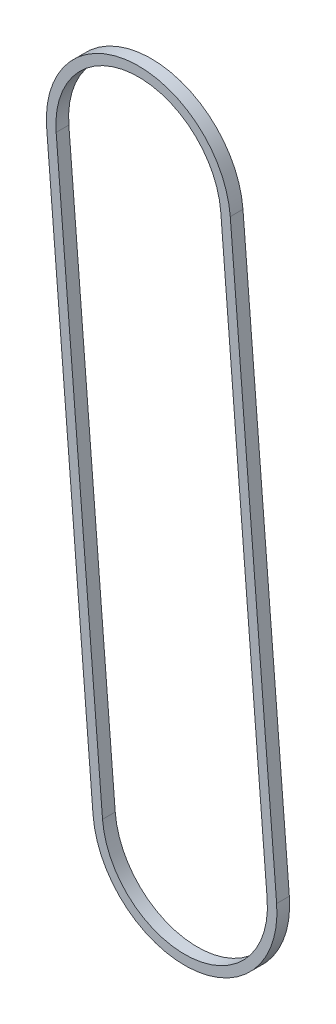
ISO-10303-21;
HEADER;
FILE_DESCRIPTION(('STEP AP214'),'2;1');
FILE_NAME('part.step','',(''),(''),'','','');
FILE_SCHEMA(('AUTOMOTIVE_DESIGN { 1 0 10303 214 1 1 1 1 }'));
ENDSEC;
DATA;
#1=APPLICATION_CONTEXT('core data for automotive mechanical design processes');
#2=APPLICATION_PROTOCOL_DEFINITION('international standard','automotive_design',2000,#1);
#3=PRODUCT_CONTEXT('',#1,'mechanical');
#4=PRODUCT('Part','Part','',(#3));
#5=PRODUCT_RELATED_PRODUCT_CATEGORY('part','',(#4));
#6=PRODUCT_DEFINITION_FORMATION('','',#4);
#7=PRODUCT_DEFINITION_CONTEXT('part definition',#1,'design');
#8=PRODUCT_DEFINITION('design','',#6,#7);
#9=PRODUCT_DEFINITION_SHAPE('','',#8);
#10=(LENGTH_UNIT() NAMED_UNIT(*) SI_UNIT(.MILLI.,.METRE.));
#11=(NAMED_UNIT(*) PLANE_ANGLE_UNIT() SI_UNIT($,.RADIAN.));
#12=(NAMED_UNIT(*) SI_UNIT($,.STERADIAN.) SOLID_ANGLE_UNIT());
#13=UNCERTAINTY_MEASURE_WITH_UNIT(LENGTH_MEASURE(1.E-05),#10,'distance_accuracy_value','');
#14=(GEOMETRIC_REPRESENTATION_CONTEXT(3) GLOBAL_UNCERTAINTY_ASSIGNED_CONTEXT((#13)) GLOBAL_UNIT_ASSIGNED_CONTEXT((#10,
#11,#12)) REPRESENTATION_CONTEXT('',''));
#15=CARTESIAN_POINT('',(0.,0.,0.));
#16=DIRECTION('',(0.,0.,1.));
#17=DIRECTION('',(1.,0.,0.));
#18=AXIS2_PLACEMENT_3D('',#15,#16,#17);
#19=CARTESIAN_POINT('',(-73.0000000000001,900.,10.));
#20=DIRECTION('',(0.,0.,1.));
#21=DIRECTION('',(1.,0.,0.));
#22=AXIS2_PLACEMENT_3D('',#19,#20,#21);
#23=PLANE('',#22);
#24=CARTESIAN_POINT('',(-73.0000000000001,900.,10.));
#25=DIRECTION('',(0.,0.,1.));
#26=DIRECTION('',(1.,0.,0.));
#27=AXIS2_PLACEMENT_3D('',#24,#25,#26);
#28=CIRCLE('',#27,145.);
#29=CARTESIAN_POINT('',(71.5253623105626,911.722612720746,10.));
#30=VERTEX_POINT('',#29);
#31=CARTESIAN_POINT('',(-217.525362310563,888.277387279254,10.));
#32=VERTEX_POINT('',#31);
#33=EDGE_CURVE('E159',#30,#32,#28,.T.);
#34=ORIENTED_EDGE('',*,*,#33,.T.);
#35=DIRECTION('',(0.0808456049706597,-0.99672663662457,0.));
#36=VECTOR('',#35,1.);
#37=CARTESIAN_POINT('',(-217.525362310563,888.277387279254,10.));
#38=LINE('',#37,#36);
#39=CARTESIAN_POINT('',(-144.525362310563,-11.7226127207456,10.));
#40=VERTEX_POINT('',#39);
#41=EDGE_CURVE('E162',#32,#40,#38,.T.);
#42=ORIENTED_EDGE('',*,*,#41,.T.);
#43=CARTESIAN_POINT('',(0.,0.,10.));
#44=DIRECTION('',(0.,0.,1.));
#45=DIRECTION('',(1.,0.,0.));
#46=AXIS2_PLACEMENT_3D('',#43,#44,#45);
#47=CIRCLE('',#46,145.);
#48=CARTESIAN_POINT('',(144.525362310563,11.7226127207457,10.));
#49=VERTEX_POINT('',#48);
#50=EDGE_CURVE('E165',#40,#49,#47,.T.);
#51=ORIENTED_EDGE('',*,*,#50,.T.);
#52=DIRECTION('',(0.0808456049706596,-0.99672663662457,0.));
#53=VECTOR('',#52,1.);
#54=CARTESIAN_POINT('',(71.5253623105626,911.722612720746,10.));
#55=LINE('',#54,#53);
#56=EDGE_CURVE('E167',#30,#49,#55,.T.);
#57=ORIENTED_EDGE('',*,*,#56,.F.);
#58=EDGE_LOOP('',(#34,#42,#51,#57));
#59=FACE_BOUND('',#58,.T.);
#60=CARTESIAN_POINT('',(0.,0.,10.));
#61=DIRECTION('',(0.,0.,1.));
#62=DIRECTION('',(1.,0.,0.));
#63=AXIS2_PLACEMENT_3D('',#60,#61,#62);
#64=CIRCLE('',#63,130.);
#65=CARTESIAN_POINT('',(-129.574462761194,-10.5099286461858,10.));
#66=VERTEX_POINT('',#65);
#67=CARTESIAN_POINT('',(129.574462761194,10.5099286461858,10.));
#68=VERTEX_POINT('',#67);
#69=EDGE_CURVE('E133',#66,#68,#64,.T.);
#70=ORIENTED_EDGE('',*,*,#69,.F.);
#71=DIRECTION('',(0.0808456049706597,-0.99672663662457,0.));
#72=VECTOR('',#71,1.);
#73=CARTESIAN_POINT('',(-202.574462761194,889.490071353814,10.));
#74=LINE('',#73,#72);
#75=CARTESIAN_POINT('',(-202.574462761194,889.490071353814,10.));
#76=VERTEX_POINT('',#75);
#77=EDGE_CURVE('E125',#76,#66,#74,.T.);
#78=ORIENTED_EDGE('',*,*,#77,.F.);
#79=CARTESIAN_POINT('',(-73.0000000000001,900.,10.));
#80=DIRECTION('',(0.,0.,1.));
#81=DIRECTION('',(1.,0.,0.));
#82=AXIS2_PLACEMENT_3D('',#79,#80,#81);
#83=CIRCLE('',#82,130.);
#84=CARTESIAN_POINT('',(56.5744627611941,910.509928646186,10.));
#85=VERTEX_POINT('',#84);
#86=EDGE_CURVE('E144',#85,#76,#83,.T.);
#87=ORIENTED_EDGE('',*,*,#86,.F.);
#88=DIRECTION('',(0.0808456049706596,-0.99672663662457,0.));
#89=VECTOR('',#88,1.);
#90=CARTESIAN_POINT('',(56.5744627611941,910.509928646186,10.));
#91=LINE('',#90,#89);
#92=EDGE_CURVE('E74',#85,#68,#91,.T.);
#93=ORIENTED_EDGE('',*,*,#92,.T.);
#94=EDGE_LOOP('',(#70,#78,#87,#93));
#95=FACE_BOUND('',#94,.T.);
#96=ADVANCED_FACE('F59',(#59,#95),#23,.T.);
#97=CARTESIAN_POINT('',(-73.0000000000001,900.,-10.));
#98=DIRECTION('',(0.,0.,1.));
#99=DIRECTION('',(1.,0.,0.));
#100=AXIS2_PLACEMENT_3D('',#97,#98,#99);
#101=PLANE('',#100);
#102=CARTESIAN_POINT('',(-73.0000000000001,900.,-10.));
#103=DIRECTION('',(0.,0.,1.));
#104=DIRECTION('',(1.,0.,0.));
#105=AXIS2_PLACEMENT_3D('',#102,#103,#104);
#106=CIRCLE('',#105,145.);
#107=CARTESIAN_POINT('',(71.5253623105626,911.722612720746,-10.));
#108=VERTEX_POINT('',#107);
#109=CARTESIAN_POINT('',(-217.525362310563,888.277387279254,-10.));
#110=VERTEX_POINT('',#109);
#111=EDGE_CURVE('E140',#108,#110,#106,.T.);
#112=ORIENTED_EDGE('',*,*,#111,.F.);
#113=DIRECTION('',(0.0808456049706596,-0.99672663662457,0.));
#114=VECTOR('',#113,1.);
#115=CARTESIAN_POINT('',(71.5253623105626,911.722612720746,-10.));
#116=LINE('',#115,#114);
#117=CARTESIAN_POINT('',(144.525362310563,11.7226127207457,-10.));
#118=VERTEX_POINT('',#117);
#119=EDGE_CURVE('E163',#108,#118,#116,.T.);
#120=ORIENTED_EDGE('',*,*,#119,.T.);
#121=CARTESIAN_POINT('',(0.,0.,-10.));
#122=DIRECTION('',(0.,0.,1.));
#123=DIRECTION('',(1.,0.,0.));
#124=AXIS2_PLACEMENT_3D('',#121,#122,#123);
#125=CIRCLE('',#124,145.);
#126=CARTESIAN_POINT('',(-144.525362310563,-11.7226127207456,-10.));
#127=VERTEX_POINT('',#126);
#128=EDGE_CURVE('E175',#127,#118,#125,.T.);
#129=ORIENTED_EDGE('',*,*,#128,.F.);
#130=DIRECTION('',(0.0808456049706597,-0.99672663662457,0.));
#131=VECTOR('',#130,1.);
#132=CARTESIAN_POINT('',(-217.525362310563,888.277387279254,-10.));
#133=LINE('',#132,#131);
#134=EDGE_CURVE('E173',#110,#127,#133,.T.);
#135=ORIENTED_EDGE('',*,*,#134,.F.);
#136=EDGE_LOOP('',(#112,#120,#129,#135));
#137=FACE_BOUND('',#136,.T.);
#138=DIRECTION('',(0.0808456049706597,-0.99672663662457,0.));
#139=VECTOR('',#138,1.);
#140=CARTESIAN_POINT('',(-202.574462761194,889.490071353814,-10.));
#141=LINE('',#140,#139);
#142=CARTESIAN_POINT('',(-202.574462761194,889.490071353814,-10.));
#143=VERTEX_POINT('',#142);
#144=CARTESIAN_POINT('',(-129.574462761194,-10.5099286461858,-10.));
#145=VERTEX_POINT('',#144);
#146=EDGE_CURVE('E82',#143,#145,#141,.T.);
#147=ORIENTED_EDGE('',*,*,#146,.T.);
#148=CARTESIAN_POINT('',(0.,0.,-10.));
#149=DIRECTION('',(0.,0.,1.));
#150=DIRECTION('',(1.,0.,0.));
#151=AXIS2_PLACEMENT_3D('',#148,#149,#150);
#152=CIRCLE('',#151,130.);
#153=CARTESIAN_POINT('',(129.574462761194,10.5099286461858,-10.));
#154=VERTEX_POINT('',#153);
#155=EDGE_CURVE('E139',#145,#154,#152,.T.);
#156=ORIENTED_EDGE('',*,*,#155,.T.);
#157=DIRECTION('',(0.0808456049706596,-0.99672663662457,0.));
#158=VECTOR('',#157,1.);
#159=CARTESIAN_POINT('',(56.5744627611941,910.509928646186,-10.));
#160=LINE('',#159,#158);
#161=CARTESIAN_POINT('',(56.5744627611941,910.509928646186,-10.));
#162=VERTEX_POINT('',#161);
#163=EDGE_CURVE('E150',#162,#154,#160,.T.);
#164=ORIENTED_EDGE('',*,*,#163,.F.);
#165=CARTESIAN_POINT('',(-73.0000000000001,900.,-10.));
#166=DIRECTION('',(0.,0.,1.));
#167=DIRECTION('',(1.,0.,0.));
#168=AXIS2_PLACEMENT_3D('',#165,#166,#167);
#169=CIRCLE('',#168,130.);
#170=EDGE_CURVE('E134',#162,#143,#169,.T.);
#171=ORIENTED_EDGE('',*,*,#170,.T.);
#172=EDGE_LOOP('',(#147,#156,#164,#171));
#173=FACE_BOUND('',#172,.T.);
#174=ADVANCED_FACE('F192',(#137,#173),#101,.F.);
#175=CARTESIAN_POINT('',(-73.0000000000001,900.,10.));
#176=DIRECTION('',(0.,0.,-1.));
#177=DIRECTION('',(-1.,0.,0.));
#178=AXIS2_PLACEMENT_3D('',#175,#176,#177);
#179=CYLINDRICAL_SURFACE('',#178,145.);
#180=ORIENTED_EDGE('',*,*,#111,.T.);
#181=DIRECTION('',(0.,0.,-1.));
#182=VECTOR('',#181,1.);
#183=CARTESIAN_POINT('',(-217.525362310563,888.277387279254,10.));
#184=LINE('',#183,#182);
#185=EDGE_CURVE('E12',#32,#110,#184,.T.);
#186=ORIENTED_EDGE('',*,*,#185,.F.);
#187=ORIENTED_EDGE('',*,*,#33,.F.);
#188=DIRECTION('',(0.,0.,-1.));
#189=VECTOR('',#188,1.);
#190=CARTESIAN_POINT('',(71.5253623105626,911.722612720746,10.));
#191=LINE('',#190,#189);
#192=EDGE_CURVE('E170',#30,#108,#191,.T.);
#193=ORIENTED_EDGE('',*,*,#192,.T.);
#194=EDGE_LOOP('',(#180,#186,#187,#193));
#195=FACE_BOUND('',#194,.T.);
#196=ADVANCED_FACE('F61',(#195),#179,.T.);
#197=CARTESIAN_POINT('',(-217.525362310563,888.277387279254,10.));
#198=DIRECTION('',(0.99672663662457,0.0808456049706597,0.));
#199=DIRECTION('',(-0.0808456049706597,0.99672663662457,0.));
#200=AXIS2_PLACEMENT_3D('',#197,#198,#199);
#201=PLANE('',#200);
#202=ORIENTED_EDGE('',*,*,#134,.T.);
#203=DIRECTION('',(0.,0.,-1.));
#204=VECTOR('',#203,1.);
#205=CARTESIAN_POINT('',(-144.525362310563,-11.7226127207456,10.));
#206=LINE('',#205,#204);
#207=EDGE_CURVE('E67',#40,#127,#206,.T.);
#208=ORIENTED_EDGE('',*,*,#207,.F.);
#209=ORIENTED_EDGE('',*,*,#41,.F.);
#210=ORIENTED_EDGE('',*,*,#185,.T.);
#211=EDGE_LOOP('',(#202,#208,#209,#210));
#212=FACE_BOUND('',#211,.T.);
#213=ADVANCED_FACE('F201',(#212),#201,.F.);
#214=CARTESIAN_POINT('',(0.,0.,10.));
#215=DIRECTION('',(0.,0.,-1.));
#216=DIRECTION('',(-1.,0.,0.));
#217=AXIS2_PLACEMENT_3D('',#214,#215,#216);
#218=CYLINDRICAL_SURFACE('',#217,145.);
#219=ORIENTED_EDGE('',*,*,#128,.T.);
#220=DIRECTION('',(0.,0.,-1.));
#221=VECTOR('',#220,1.);
#222=CARTESIAN_POINT('',(144.525362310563,11.7226127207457,10.));
#223=LINE('',#222,#221);
#224=EDGE_CURVE('E181',#49,#118,#223,.T.);
#225=ORIENTED_EDGE('',*,*,#224,.F.);
#226=ORIENTED_EDGE('',*,*,#50,.F.);
#227=ORIENTED_EDGE('',*,*,#207,.T.);
#228=EDGE_LOOP('',(#219,#225,#226,#227));
#229=FACE_BOUND('',#228,.T.);
#230=ADVANCED_FACE('F187',(#229),#218,.T.);
#231=CARTESIAN_POINT('',(71.5253623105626,911.722612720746,10.));
#232=DIRECTION('',(0.99672663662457,0.0808456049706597,0.));
#233=DIRECTION('',(-0.0808456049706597,0.99672663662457,0.));
#234=AXIS2_PLACEMENT_3D('',#231,#232,#233);
#235=PLANE('',#234);
#236=ORIENTED_EDGE('',*,*,#119,.F.);
#237=ORIENTED_EDGE('',*,*,#192,.F.);
#238=ORIENTED_EDGE('',*,*,#56,.T.);
#239=ORIENTED_EDGE('',*,*,#224,.T.);
#240=EDGE_LOOP('',(#236,#237,#238,#239));
#241=FACE_BOUND('',#240,.T.);
#242=ADVANCED_FACE('F196',(#241),#235,.T.);
#243=CARTESIAN_POINT('',(-202.574462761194,889.490071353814,10.));
#244=DIRECTION('',(0.99672663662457,0.0808456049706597,0.));
#245=DIRECTION('',(-0.0808456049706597,0.99672663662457,0.));
#246=AXIS2_PLACEMENT_3D('',#243,#244,#245);
#247=PLANE('',#246);
#248=ORIENTED_EDGE('',*,*,#146,.F.);
#249=DIRECTION('',(0.,0.,-1.));
#250=VECTOR('',#249,1.);
#251=CARTESIAN_POINT('',(-202.574462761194,889.490071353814,10.));
#252=LINE('',#251,#250);
#253=EDGE_CURVE('E129',#76,#143,#252,.T.);
#254=ORIENTED_EDGE('',*,*,#253,.F.);
#255=ORIENTED_EDGE('',*,*,#77,.T.);
#256=DIRECTION('',(0.,0.,-1.));
#257=VECTOR('',#256,1.);
#258=CARTESIAN_POINT('',(-129.574462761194,-10.5099286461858,10.));
#259=LINE('',#258,#257);
#260=EDGE_CURVE('E128',#66,#145,#259,.T.);
#261=ORIENTED_EDGE('',*,*,#260,.T.);
#262=EDGE_LOOP('',(#248,#254,#255,#261));
#263=FACE_BOUND('',#262,.T.);
#264=ADVANCED_FACE('F127',(#263),#247,.T.);
#265=CARTESIAN_POINT('',(0.,0.,10.));
#266=DIRECTION('',(0.,0.,-1.));
#267=DIRECTION('',(-1.,0.,0.));
#268=AXIS2_PLACEMENT_3D('',#265,#266,#267);
#269=CYLINDRICAL_SURFACE('',#268,130.);
#270=ORIENTED_EDGE('',*,*,#155,.F.);
#271=ORIENTED_EDGE('',*,*,#260,.F.);
#272=ORIENTED_EDGE('',*,*,#69,.T.);
#273=DIRECTION('',(0.,0.,-1.));
#274=VECTOR('',#273,1.);
#275=CARTESIAN_POINT('',(129.574462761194,10.5099286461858,10.));
#276=LINE('',#275,#274);
#277=EDGE_CURVE('E141',#68,#154,#276,.T.);
#278=ORIENTED_EDGE('',*,*,#277,.T.);
#279=EDGE_LOOP('',(#270,#271,#272,#278));
#280=FACE_BOUND('',#279,.T.);
#281=ADVANCED_FACE('F137',(#280),#269,.F.);
#282=CARTESIAN_POINT('',(56.5744627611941,910.509928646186,10.));
#283=DIRECTION('',(0.99672663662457,0.0808456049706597,0.));
#284=DIRECTION('',(-0.0808456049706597,0.99672663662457,0.));
#285=AXIS2_PLACEMENT_3D('',#282,#283,#284);
#286=PLANE('',#285);
#287=ORIENTED_EDGE('',*,*,#163,.T.);
#288=ORIENTED_EDGE('',*,*,#277,.F.);
#289=ORIENTED_EDGE('',*,*,#92,.F.);
#290=DIRECTION('',(0.,0.,-1.));
#291=VECTOR('',#290,1.);
#292=CARTESIAN_POINT('',(56.5744627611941,910.509928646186,10.));
#293=LINE('',#292,#291);
#294=EDGE_CURVE('E156',#85,#162,#293,.T.);
#295=ORIENTED_EDGE('',*,*,#294,.T.);
#296=EDGE_LOOP('',(#287,#288,#289,#295));
#297=FACE_BOUND('',#296,.T.);
#298=ADVANCED_FACE('F238',(#297),#286,.F.);
#299=CARTESIAN_POINT('',(-73.0000000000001,900.,10.));
#300=DIRECTION('',(0.,0.,-1.));
#301=DIRECTION('',(-1.,0.,0.));
#302=AXIS2_PLACEMENT_3D('',#299,#300,#301);
#303=CYLINDRICAL_SURFACE('',#302,130.);
#304=ORIENTED_EDGE('',*,*,#170,.F.);
#305=ORIENTED_EDGE('',*,*,#294,.F.);
#306=ORIENTED_EDGE('',*,*,#86,.T.);
#307=ORIENTED_EDGE('',*,*,#253,.T.);
#308=EDGE_LOOP('',(#304,#305,#306,#307));
#309=FACE_BOUND('',#308,.T.);
#310=ADVANCED_FACE('F244',(#309),#303,.F.);
#311=CLOSED_SHELL('',(#96,#174,#196,#213,#230,#242,#264,#281,#298,#310));
#312=MANIFOLD_SOLID_BREP('B2',#311);
#313=ADVANCED_BREP_SHAPE_REPRESENTATION('',(#18,#312),#14);
#314=SHAPE_DEFINITION_REPRESENTATION(#9,#313);
ENDSEC;
END-ISO-10303-21;
